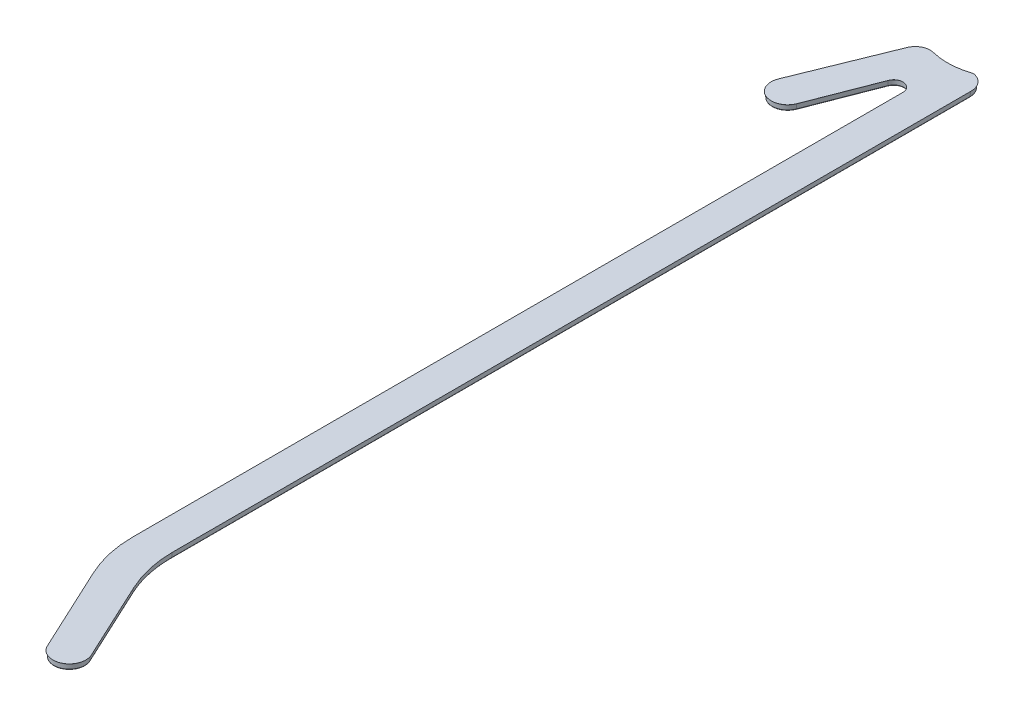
from build123d import *

# Parameters (mm, degrees)
BASE_EXTRUDE_DEPTH      = 300
BASE_EXTRUDE_DEPTH_BACK = 30
BOSS_EXTRUDE1_DEPTH     = 1.5
BOSS_EXTRUDE1_TAPER     = 3.0000000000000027
CONG_1_R                = 30
CONG_2_R                = 0.2
SKETCH3_W               = 330
SKETCH3_H               = 5
CUT_EXTRUDE1_DEPTH      = 311.5237512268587


with BuildPart() as part:
    # Sketch1 → Base-Extrude (new, two sides: drawn at the far end of the back side and taken through both)
    with BuildSketch(Plane.XY.offset(-BASE_EXTRUDE_DEPTH_BACK)):
        Polygon((-40, 4.999999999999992), (40, 5.000000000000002), (40, 1.99e-15), (-40, -7.81e-15), align=None)
    extrude(amount=BASE_EXTRUDE_DEPTH + BASE_EXTRUDE_DEPTH_BACK)

    # Sketch2 → Boss-Extrude1 (add)
    with BuildSketch(Plane(origin=(1.194e-14, 5.97e-15, -97.5), x_dir=(1, 1.2e-16, 0), z_dir=(1.2e-16, -1, 0))):
        with BuildLine():
            ThreePointArc((-4, 106.45774452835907), (-6.040550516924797, 104.00032592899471), (-8.831124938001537, 105.55449676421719))
            Line((-8.831124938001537, 105.55449676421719), (-15.302677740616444, 122.25644580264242))
            ThreePointArc((-15.302677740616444, 122.25644580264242), (-20.50631224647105, 124.52982592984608), (-22.739610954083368, 119.30886374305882))
            Line((-22.739610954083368, 119.30886374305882), (-13.350811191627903, 96.14202061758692))
            ThreePointArc((-13.350811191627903, 96.14202061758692), (-11.638676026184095, 94.27714652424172), (-9.123105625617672, 93.99242250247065))
            ThreePointArc((-9.123105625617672, 93.99242250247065), (-4.22307422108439, 94.48223737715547), (0.6117647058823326, 93.54705882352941))
            ThreePointArc((0.6117647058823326, 93.54705882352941), (3.0370264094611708, 94.89683450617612), (3.999999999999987, 97.5))
            Line((3.999999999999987, 97.5), (3.999999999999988, 306.6132213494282))
            Line((3.999999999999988, 306.6132213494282), (16.30377900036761, 332.99876056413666))
            ThreePointArc((16.30377900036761, 332.99876056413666), (14.369020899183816, 338.3144647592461), (9.053316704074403, 336.3797066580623))
            Line((9.053316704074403, 336.3797066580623), (-1.189233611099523, 314.4144866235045))
            ThreePointArc((-1.189233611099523, 314.4144866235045), (-3.2888802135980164, 308.2291271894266), (-4.000000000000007, 301.73593877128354))
            Line((-4.000000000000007, 301.73593877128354), (-4, 106.45774452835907))
        make_face()
    extrude(amount=BOSS_EXTRUDE1_DEPTH, taper=BOSS_EXTRUDE1_TAPER)

    # Cong_1
    cong_1_edges = [part.edges().sort_by_distance(p)[0] for p in [
        (3.9606941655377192, -0.7499999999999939, 209.12193524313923),
    ]]
    fillet(cong_1_edges, radius=CONG_1_R)

    # Cong_2
    cong_2_edges = [part.edges().sort_by_distance(p)[0] for p in [
        (-20.506312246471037, 3.46e-15, 27.029825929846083),
        (-18.045211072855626, 3.76e-15, 10.225442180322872),
        (-11.638676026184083, 4.54e-15, -3.222853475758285),
        (-4.223074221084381, 5.45e-15, -3.017762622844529),
        (3.0370264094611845, 6.34e-15, -2.60316549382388),
        (3.9999999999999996, 6.46e-15, 101.23574810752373),
        (4.710121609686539, -2.33e-15, 208.95579117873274),
        (-12.066901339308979, 4.49e-15, 16.405471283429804),
        (-6.040550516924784, 5.23e-15, 6.500325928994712),
        (-3.9999999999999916, 5.48e-15, 106.5968416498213),
        (-3.288880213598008, 5.57e-15, 210.7291271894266),
        (3.932041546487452, 6.45e-15, 227.8970966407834),
        (14.369020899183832, 7.73e-15, 240.8144647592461),
        (4.003287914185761, -1.4999999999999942, 227.86387391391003),
        (14.3357981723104, -1.4999999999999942, 240.74321839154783),
        (11.480417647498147, -1.4999999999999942, 225.3410398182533),
        (4.631509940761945, -1.4999999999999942, 208.9732189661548),
        (3.9213883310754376, -1.4999999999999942, 101.24446200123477),
        (2.9836881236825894, -1.4999999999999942, -2.5445808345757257),
        (-4.2293602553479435, -1.4999999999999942, -2.9387840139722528),
        (-11.60304663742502, -1.4999999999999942, -3.1527796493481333),
        (-17.97235508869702, -1.4999999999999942, 10.25496844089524),
        (-20.477347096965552, -1.4999999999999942, 26.9567450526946),
        (-12.140202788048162, -1.4999999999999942, 16.377068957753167),
        (-6.026103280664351, -1.4999999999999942, 6.423053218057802),
        (-3.9213883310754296, -1.4999999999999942, 106.59684164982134),
        (-3.212131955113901, -1.4999999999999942, 210.71211251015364),
        (11.555346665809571, 7.39e-15, 225.3157145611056),
    ]]
    fillet(cong_2_edges, radius=CONG_2_R)

    # Sketch3 → Cut-Extrude1 (cut, through all)
    with BuildSketch(Plane.ZY.offset(40)):
        with Locations((135, 2.499999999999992)):
            Rectangle(SKETCH3_W, SKETCH3_H)
    extrude(amount=-CUT_EXTRUDE1_DEPTH, mode=Mode.SUBTRACT)


solid = part.part
